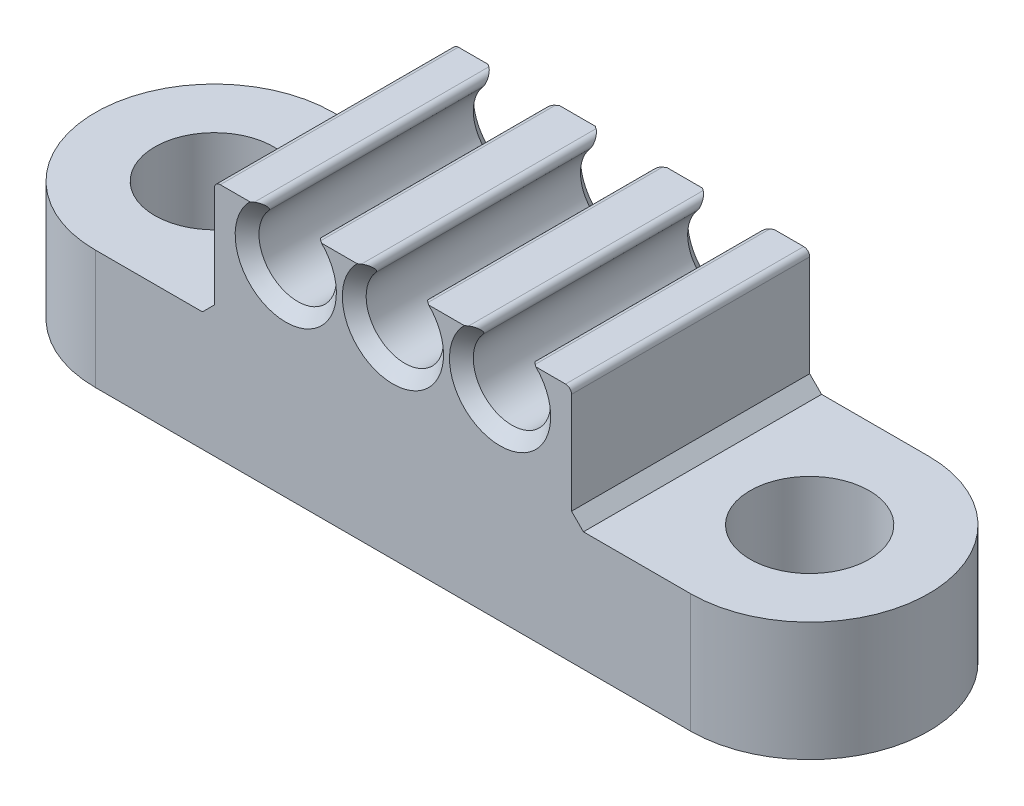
from build123d import *

# Parameters (mm, degrees)
SKIZZE1_R                            = 5
AUFSATZ_LINEAR_AUSTRAGEN1_DEPTH      = 10
SKIZZE2_W                            = 30
SKIZZE2_H                            = 20
AUFSATZ_LINEAR_AUSTRAGEN2_DEPTH      = 10
SCHNITT_LINEAR_AUSTRAGEN1_DEPTH      = 46
SCHNITT_LINEAR_AUSTRAGEN1_DEPTH_BACK = 46
SKIZZE3_R                            = 3.25
FASE3_SIZE                           = 1
VERRUNDUNG1_R                        = 0.5
FASE1_SIZE                           = 1


with BuildPart() as part:
    # Skizze1 → Aufsatz-Linear austragen1 (new body)
    with BuildSketch(Plane(origin=(0, 0, 0), x_dir=(1, 0, 0), z_dir=(0, 1, 0))):
        with BuildLine():
            Line((-25, -10), (25, -10))
            ThreePointArc((25, -10), (35, 0), (25, 10))
            Line((25, 10), (-25, 10))
            ThreePointArc((-25, 10), (-35, 0), (-25, -10))
        make_face()
        with Locations(Location((-25, 0, 0), (0, 0, 270))):
            Circle(SKIZZE1_R, mode=Mode.SUBTRACT)
        with Locations(Location((25, 0, 0), (0, 0, 90))):
            Circle(SKIZZE1_R, mode=Mode.SUBTRACT)
    extrude(amount=AUFSATZ_LINEAR_AUSTRAGEN1_DEPTH)

    # Skizze2 → Aufsatz-Linear austragen2 (add)
    with BuildSketch(Plane(origin=(0, 10, 0), x_dir=(1, 0, 0), z_dir=(0, 1, 0))):
        Rectangle(SKIZZE2_W, SKIZZE2_H)
    extrude(amount=AUFSATZ_LINEAR_AUSTRAGEN2_DEPTH)

    # Skizze3 → Schnitt-Linear austragen1 (cut, two sides: drawn at the far end of the back side and taken through both)
    with BuildSketch(Plane.XY.offset(10).offset(-SCHNITT_LINEAR_AUSTRAGEN1_DEPTH_BACK)):
        with Locations((0, 17)):
            Circle(SKIZZE3_R)
        with Locations((9, 17)):
            Circle(SKIZZE3_R)
        with Locations((-9, 17)):
            Circle(SKIZZE3_R)
    extrude(amount=SCHNITT_LINEAR_AUSTRAGEN1_DEPTH + SCHNITT_LINEAR_AUSTRAGEN1_DEPTH_BACK, mode=Mode.SUBTRACT)

    # Fase3
    fase3_edges = [part.edges().sort_by_distance(p)[0] for p in [
        (-9, 13.75, -10),
        (-9, 13.75, 10),
        (0, 13.75, -10),
        (0, 13.75, 10),
        (9, 13.75, -10),
        (9, 13.75, 10),
    ]]
    chamfer(fase3_edges, length=FASE3_SIZE)

    # Verrundung1
    verrundung1_edges = [part.edges().sort_by_distance(p)[0] for p in [
        (15, 20, 0),
        (-15, 20, 0),
        (10.25, 20, 0),
        (7.75, 20, 0),
        (1.25, 20, 0),
        (-1.25, 20, 0),
        (-7.75, 20, 0),
        (-10.25, 20, 0),
    ]]
    fillet(verrundung1_edges, radius=VERRUNDUNG1_R)

    # Fase1
    fase1_edges = [part.edges().sort_by_distance(p)[0] for p in [
        (15, 10, 0),
        (-15, 10, 0),
    ]]
    chamfer(fase1_edges, length=FASE1_SIZE)


solid = part.part
